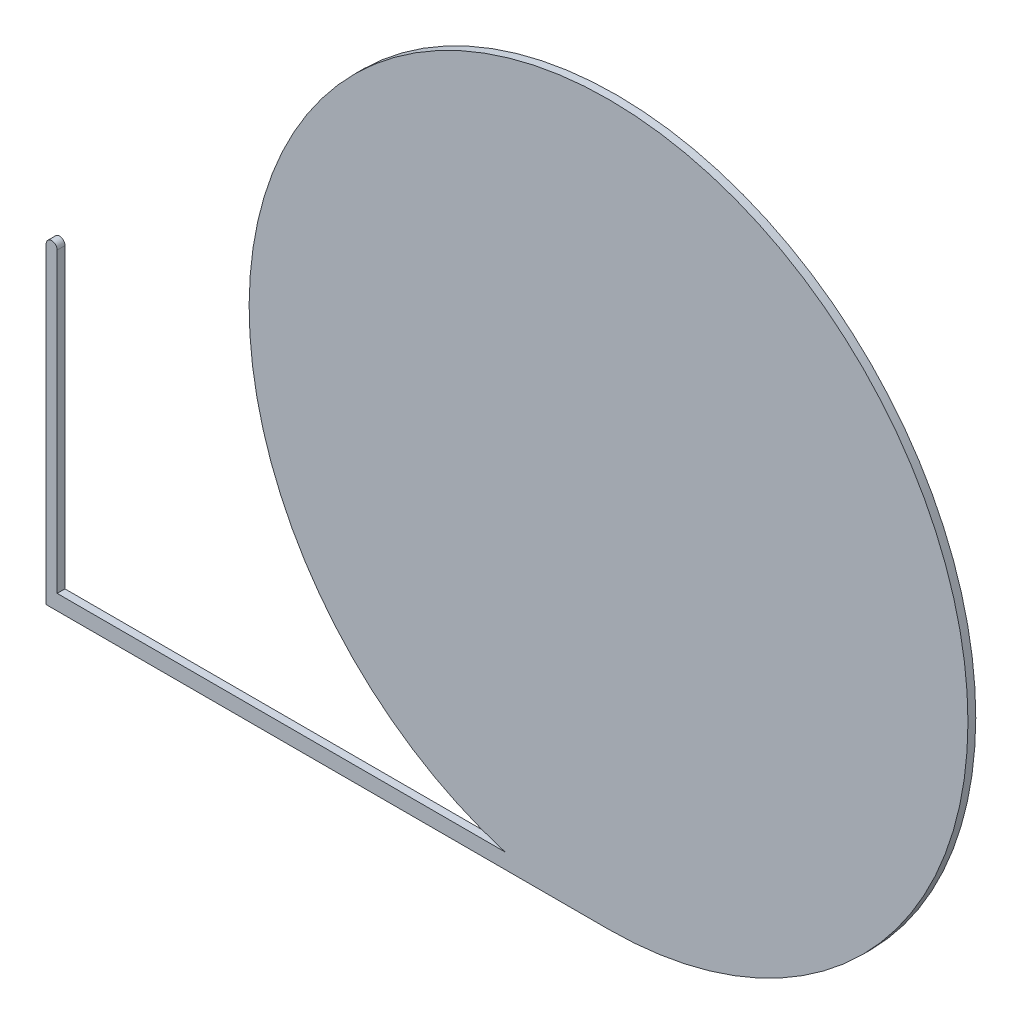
from build123d import *

# Parameters (mm, degrees)
EXTRUSION1_DEPTH = 10


with BuildPart() as part:
    # Esquisse1 → Extrusion1 (new body)
    with BuildSketch(Plane.XY):
        with BuildLine():
            Line((0, -460), (-719.68, -460))
            Line((-719.68, -460), (-719.68, -60))
            ThreePointArc((-719.68, -60), (-719.486059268, -58.363675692), (-718.914983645, -56.818022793))
            ThreePointArc((-718.914983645, -56.818022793), (-711.043675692, -53.193940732), (-705.68, -60))
            Line((-705.68, -60), (-705.68, -440.513207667))
            Line((-705.68, -440.513207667), (-132.469294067, -440.513207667))
            ThreePointArc((-132.469294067, -440.513207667), (66.947458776, 455.102227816), (0, -460))
        make_face()
    extrude(amount=EXTRUSION1_DEPTH)


solid = part.part
